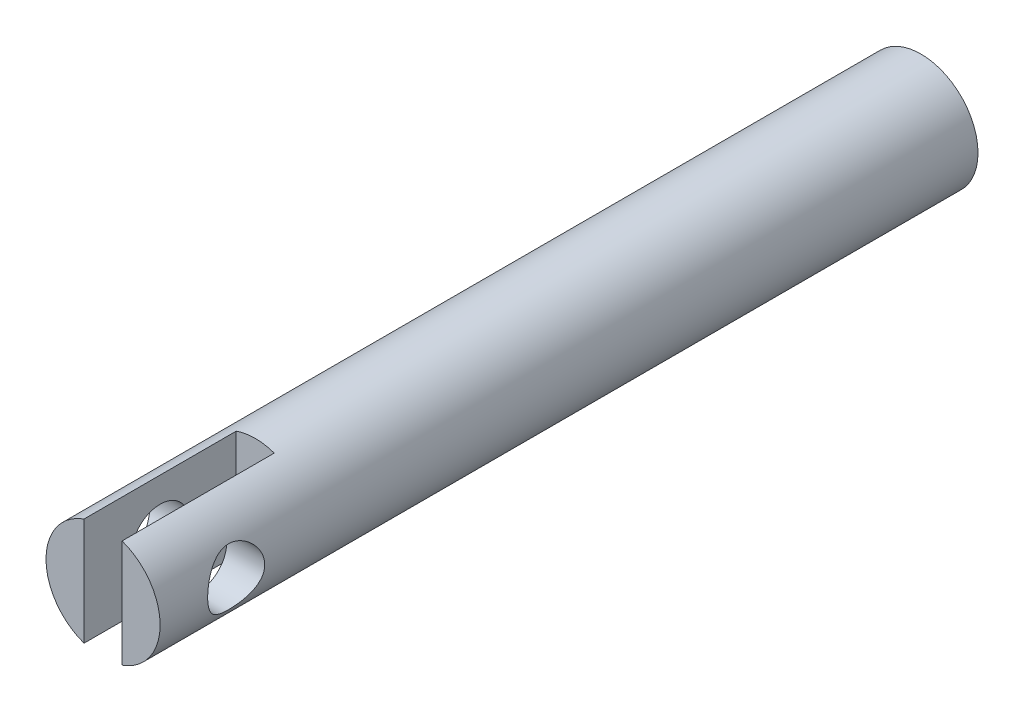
from build123d import *

# Parameters (mm, degrees)
SKETCH1_R                        = 4.7625
EXTRUDE1_DEPTH                   = 68.2625
CUT_EXTRUDE1_DEPTH               = 69.593962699
CUT_EXTRUDE1_DEPTH_BACK          = 69.593962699
SKETCH2_W                        = 3.175
SKETCH2_H                        = 12.7
CUT_EXTRUDE2_DEPTH               = 69.593962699
CUT_EXTRUDE2_DEPTH_BACK          = 69.593962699
SKETCH3_R                        = 2.38125
F_10_32_TAPPED_HOLE1_D           = 4.0386
F_10_32_TAPPED_HOLE1_DEPTH       = 15.07744
F_10_32_TAPPED_HOLE1_CBORE_D     = 4.826
F_10_32_TAPPED_HOLE1_CBORE_DEPTH = 12.7
F_10_32_TAPPED_HOLE1_TIP         = 1.213317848


with BuildPart() as part:
    # Sketch1 → Extrude1 (new body)
    with BuildSketch(Plane.XY):
        Circle(SKETCH1_R)
    extrude(amount=EXTRUDE1_DEPTH)

    # Sketch2 → Cut-Extrude1 (cut, two sides: drawn at the far end of the back side and taken through both)
    with BuildSketch(Plane(origin=(0, 0, 0), x_dir=(1, 0, 0), z_dir=(0, 1, 0)).offset(-CUT_EXTRUDE1_DEPTH_BACK)):
        with Locations((0, -61.9125)):
            Rectangle(SKETCH2_W, SKETCH2_H)
    extrude(amount=CUT_EXTRUDE1_DEPTH + CUT_EXTRUDE1_DEPTH_BACK, mode=Mode.SUBTRACT)

    # Sketch3 → Cut-Extrude2 (cut, two sides: drawn at the far end of the back side and taken through both)
    with BuildSketch(Plane(origin=(0, 0, 0), x_dir=(0, 0, -1), z_dir=(1, 0, 0)).offset(-CUT_EXTRUDE2_DEPTH_BACK)):
        with Locations((-61.9125, 0)):
            Circle(SKETCH3_R)
    extrude(amount=CUT_EXTRUDE2_DEPTH + CUT_EXTRUDE2_DEPTH_BACK, mode=Mode.SUBTRACT)

    # 10-32 Tapped Hole1
    with Locations(Plane(origin=(0, 0, 0), x_dir=(-1, 0, 0), z_dir=(0, 0, -1))):
        with Locations((0, 0)):
            CounterBoreHole(F_10_32_TAPPED_HOLE1_D / 2, F_10_32_TAPPED_HOLE1_CBORE_D / 2, F_10_32_TAPPED_HOLE1_CBORE_DEPTH, depth=F_10_32_TAPPED_HOLE1_DEPTH)
            with Locations((0, 0, -(F_10_32_TAPPED_HOLE1_DEPTH + F_10_32_TAPPED_HOLE1_TIP / 2))):  # 118° drill point
                Cone(0, F_10_32_TAPPED_HOLE1_D / 2, F_10_32_TAPPED_HOLE1_TIP, mode=Mode.SUBTRACT)


solid = part.part
